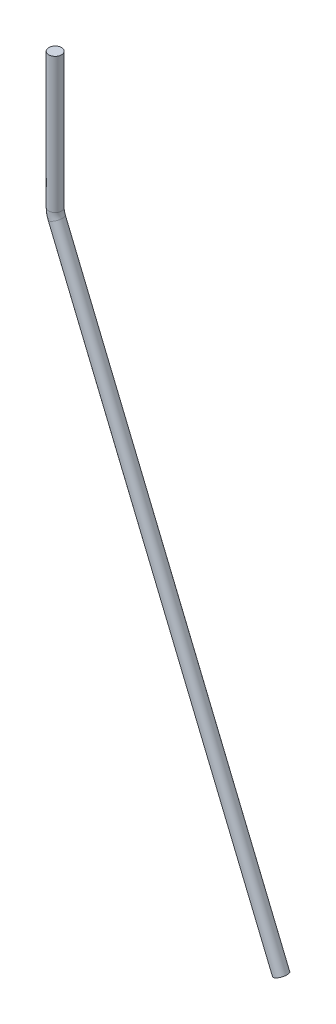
from build123d import *

# Parameters (mm, degrees)
ESQUISSE2_R      = 3
ESQUISSE3_R      = 3
EXTRUSION1_DEPTH = 6


with BuildPart() as part:
    # Balayage1: sweep along a path in Esquisse1
    with BuildLine(Plane.XY) as balayage1_path:
        Line((0, 0), (0, -58.015411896))
        ThreePointArc((0, -58.015411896), (0.191296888, -59.962035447), (0.75786865, -61.834182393))
        Line((0.75786865, -61.834182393), (106.925573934, -318.779677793))
    # Esquisse2 → Balayage1 (sweep)
    with BuildSketch(Plane(origin=(0, 0, 0), x_dir=(1, 0, 0), z_dir=(0, 1, 0))):
        Circle(ESQUISSE2_R)
    sweep(path=balayage1_path.line)

    # Esquisse3 → Extrusion1 (add)
    with BuildSketch(Plane(origin=(0, 0, 0), x_dir=(1, 0, 0), z_dir=(0, 1, 0))):
        with Locations(Location((0, 0, 0), (0, 0, 180))):
            Circle(ESQUISSE3_R)
    extrude(amount=EXTRUSION1_DEPTH)


solid = part.part
